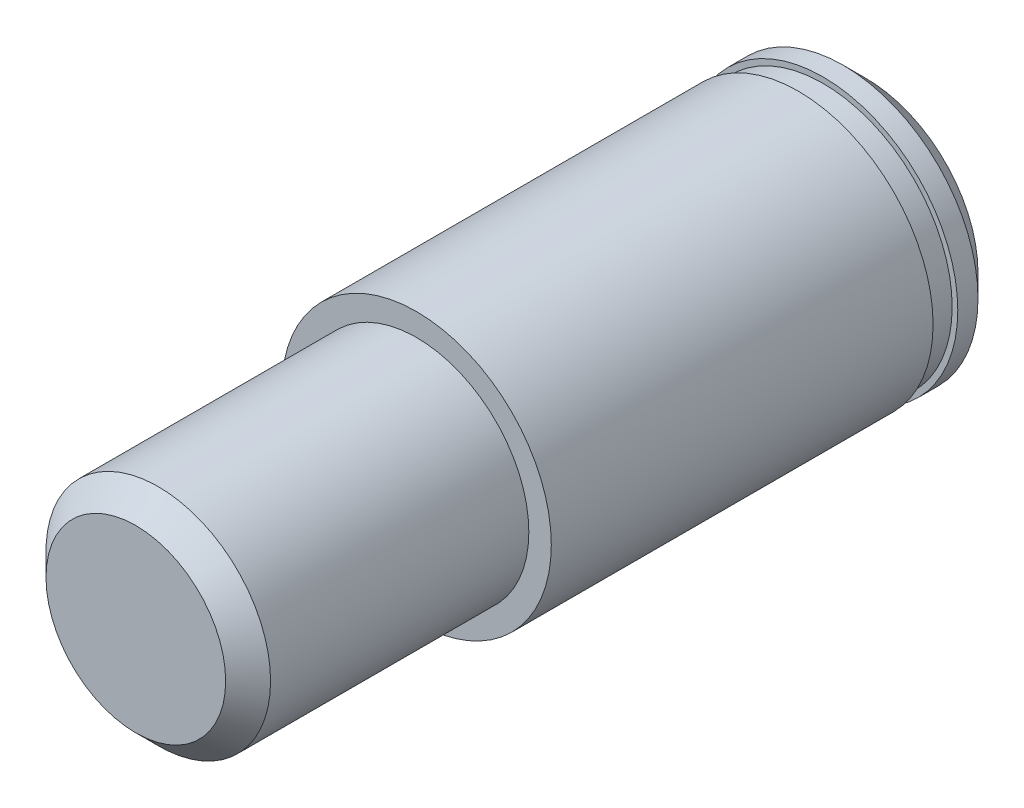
from build123d import *

# Parameters (mm, degrees)
ESQUISSE1_R          = 6
BASE_EXTRUSION_DEPTH = 1.9
ESQUISSE2_R          = 5.75
BOSS_EXTRU_1_DEPTH   = 1.1
ESQUISSE3_R          = 6
BOSS_EXTRU_2_DEPTH   = 17
ESQUISSE4_R          = 5
BOSS_EXTRU_3_DEPTH   = 12.5
CHANFREIN1_SIZE      = 1


with BuildPart() as part:
    # Esquisse1 → Base-Extrusion (new body)
    with BuildSketch(Plane.XY):
        with Locations(Location((0, 0, 0), (0, 0, 180))):
            Circle(ESQUISSE1_R)
    extrude(amount=BASE_EXTRUSION_DEPTH)

    # Esquisse2 → Boss.-Extru.1 (add)
    with BuildSketch(Plane.XY.offset(1.9)):
        Circle(ESQUISSE2_R)
    extrude(amount=BOSS_EXTRU_1_DEPTH)

    # Esquisse3 → Boss.-Extru.2 (add)
    with BuildSketch(Plane.XY.offset(3)):
        with Locations(Location((0, 0, 0), (0, 0, 180))):
            Circle(ESQUISSE3_R)
    extrude(amount=BOSS_EXTRU_2_DEPTH)

    # Esquisse4 → Boss.-Extru.3 (add)
    with BuildSketch(Plane.XY.offset(20)):
        Circle(ESQUISSE4_R)
    extrude(amount=BOSS_EXTRU_3_DEPTH)

    # Chanfrein1
    chanfrein1_edges = [part.edges().sort_by_distance(p)[0] for p in [
        (-5, 0, 32.5),
        (6, 0, 0),
    ]]
    chamfer(chanfrein1_edges, length=CHANFREIN1_SIZE)


solid = part.part
